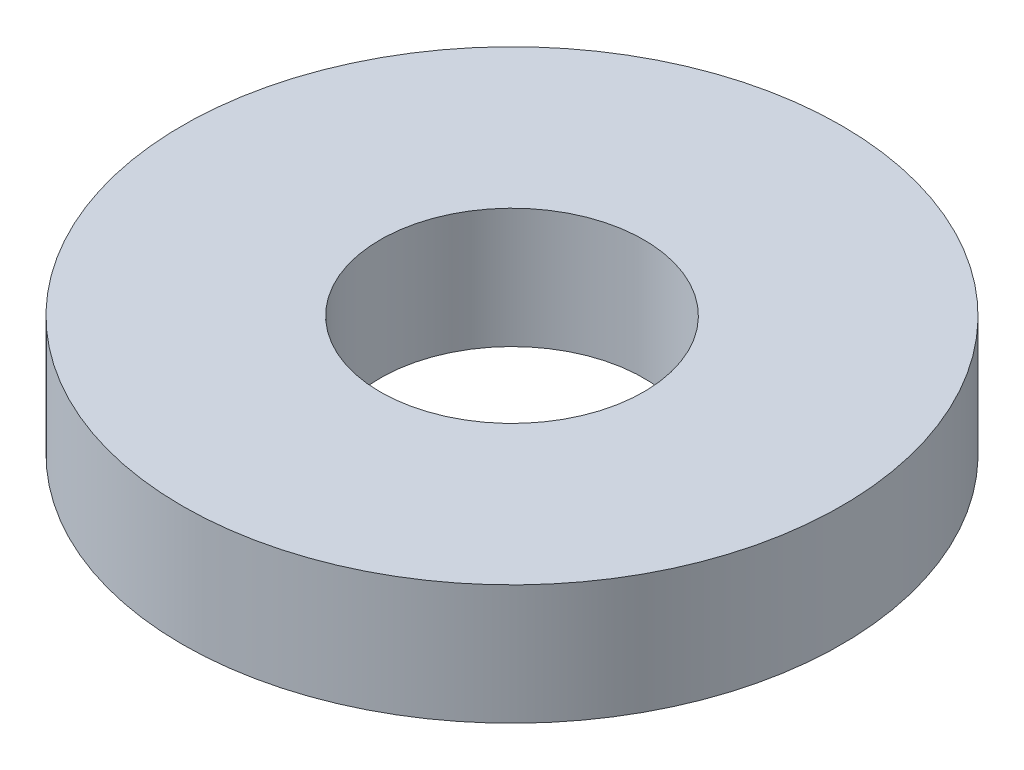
ISO-10303-21;
HEADER;
FILE_DESCRIPTION(('STEP AP214'),'2;1');
FILE_NAME('part.step','',(''),(''),'','','');
FILE_SCHEMA(('AUTOMOTIVE_DESIGN { 1 0 10303 214 1 1 1 1 }'));
ENDSEC;
DATA;
#1=APPLICATION_CONTEXT('core data for automotive mechanical design processes');
#2=APPLICATION_PROTOCOL_DEFINITION('international standard','automotive_design',2000,#1);
#3=PRODUCT_CONTEXT('',#1,'mechanical');
#4=PRODUCT('Part','Part','',(#3));
#5=PRODUCT_RELATED_PRODUCT_CATEGORY('part','',(#4));
#6=PRODUCT_DEFINITION_FORMATION('','',#4);
#7=PRODUCT_DEFINITION_CONTEXT('part definition',#1,'design');
#8=PRODUCT_DEFINITION('design','',#6,#7);
#9=PRODUCT_DEFINITION_SHAPE('','',#8);
#10=(LENGTH_UNIT() NAMED_UNIT(*) SI_UNIT(.MILLI.,.METRE.));
#11=(NAMED_UNIT(*) PLANE_ANGLE_UNIT() SI_UNIT($,.RADIAN.));
#12=(NAMED_UNIT(*) SI_UNIT($,.STERADIAN.) SOLID_ANGLE_UNIT());
#13=UNCERTAINTY_MEASURE_WITH_UNIT(LENGTH_MEASURE(1.E-05),#10,'distance_accuracy_value','');
#14=(GEOMETRIC_REPRESENTATION_CONTEXT(3) GLOBAL_UNCERTAINTY_ASSIGNED_CONTEXT((#13)) GLOBAL_UNIT_ASSIGNED_CONTEXT((#10,
#11,#12)) REPRESENTATION_CONTEXT('',''));
#15=CARTESIAN_POINT('',(0.,0.,0.));
#16=DIRECTION('',(0.,0.,1.));
#17=DIRECTION('',(1.,0.,0.));
#18=AXIS2_PLACEMENT_3D('',#15,#16,#17);
#19=CARTESIAN_POINT('',(0.,1.,0.));
#20=DIRECTION('',(0.,-1.,0.));
#21=DIRECTION('',(0.,0.,-1.));
#22=AXIS2_PLACEMENT_3D('',#19,#20,#21);
#23=CYLINDRICAL_SURFACE('',#22,2.75);
#24=CARTESIAN_POINT('',(0.,1.,0.));
#25=DIRECTION('',(0.,1.,0.));
#26=DIRECTION('',(0.,0.,1.));
#27=AXIS2_PLACEMENT_3D('',#24,#25,#26);
#28=CIRCLE('',#27,2.75);
#29=CARTESIAN_POINT('',(0.,1.,2.75));
#30=VERTEX_POINT('',#29);
#31=EDGE_CURVE('E10',#30,#30,#28,.T.);
#32=ORIENTED_EDGE('',*,*,#31,.F.);
#33=EDGE_LOOP('',(#32));
#34=FACE_BOUND('',#33,.T.);
#35=CARTESIAN_POINT('',(0.,0.,0.));
#36=DIRECTION('',(0.,1.,0.));
#37=DIRECTION('',(0.,0.,1.));
#38=AXIS2_PLACEMENT_3D('',#35,#36,#37);
#39=CIRCLE('',#38,2.75);
#40=CARTESIAN_POINT('',(0.,0.,2.75));
#41=VERTEX_POINT('',#40);
#42=EDGE_CURVE('E38',#41,#41,#39,.T.);
#43=ORIENTED_EDGE('',*,*,#42,.T.);
#44=EDGE_LOOP('',(#43));
#45=FACE_BOUND('',#44,.T.);
#46=ADVANCED_FACE('F35',(#34,#45),#23,.T.);
#47=CARTESIAN_POINT('',(0.,1.,0.));
#48=DIRECTION('',(0.,1.,0.));
#49=DIRECTION('',(0.,0.,1.));
#50=AXIS2_PLACEMENT_3D('',#47,#48,#49);
#51=PLANE('',#50);
#52=CARTESIAN_POINT('',(0.,1.,0.));
#53=DIRECTION('',(0.,1.,0.));
#54=DIRECTION('',(0.,0.,1.));
#55=AXIS2_PLACEMENT_3D('',#52,#53,#54);
#56=CIRCLE('',#55,1.1);
#57=CARTESIAN_POINT('',(0.,1.,1.1));
#58=VERTEX_POINT('',#57);
#59=EDGE_CURVE('E47',#58,#58,#56,.T.);
#60=ORIENTED_EDGE('',*,*,#59,.F.);
#61=EDGE_LOOP('',(#60));
#62=FACE_BOUND('',#61,.T.);
#63=ORIENTED_EDGE('',*,*,#31,.T.);
#64=EDGE_LOOP('',(#63));
#65=FACE_BOUND('',#64,.T.);
#66=ADVANCED_FACE('F62',(#62,#65),#51,.T.);
#67=CARTESIAN_POINT('',(0.,0.,0.));
#68=DIRECTION('',(0.,1.,0.));
#69=DIRECTION('',(0.,0.,1.));
#70=AXIS2_PLACEMENT_3D('',#67,#68,#69);
#71=PLANE('',#70);
#72=CARTESIAN_POINT('',(0.,0.,0.));
#73=DIRECTION('',(0.,1.,0.));
#74=DIRECTION('',(0.,0.,1.));
#75=AXIS2_PLACEMENT_3D('',#72,#73,#74);
#76=CIRCLE('',#75,1.1);
#77=CARTESIAN_POINT('',(0.,0.,1.1));
#78=VERTEX_POINT('',#77);
#79=EDGE_CURVE('E45',#78,#78,#76,.T.);
#80=ORIENTED_EDGE('',*,*,#79,.T.);
#81=EDGE_LOOP('',(#80));
#82=FACE_BOUND('',#81,.T.);
#83=ORIENTED_EDGE('',*,*,#42,.F.);
#84=EDGE_LOOP('',(#83));
#85=FACE_BOUND('',#84,.T.);
#86=ADVANCED_FACE('F53',(#82,#85),#71,.F.);
#87=CARTESIAN_POINT('',(0.,0.,0.));
#88=DIRECTION('',(0.,1.,0.));
#89=DIRECTION('',(0.,0.,1.));
#90=AXIS2_PLACEMENT_3D('',#87,#88,#89);
#91=CYLINDRICAL_SURFACE('',#90,1.1);
#92=ORIENTED_EDGE('',*,*,#79,.F.);
#93=EDGE_LOOP('',(#92));
#94=FACE_BOUND('',#93,.T.);
#95=ORIENTED_EDGE('',*,*,#59,.T.);
#96=EDGE_LOOP('',(#95));
#97=FACE_BOUND('',#96,.T.);
#98=ADVANCED_FACE('F56',(#94,#97),#91,.F.);
#99=CLOSED_SHELL('',(#46,#66,#86,#98));
#100=MANIFOLD_SOLID_BREP('B2',#99);
#101=ADVANCED_BREP_SHAPE_REPRESENTATION('',(#18,#100),#14);
#102=SHAPE_DEFINITION_REPRESENTATION(#9,#101);
ENDSEC;
END-ISO-10303-21;
